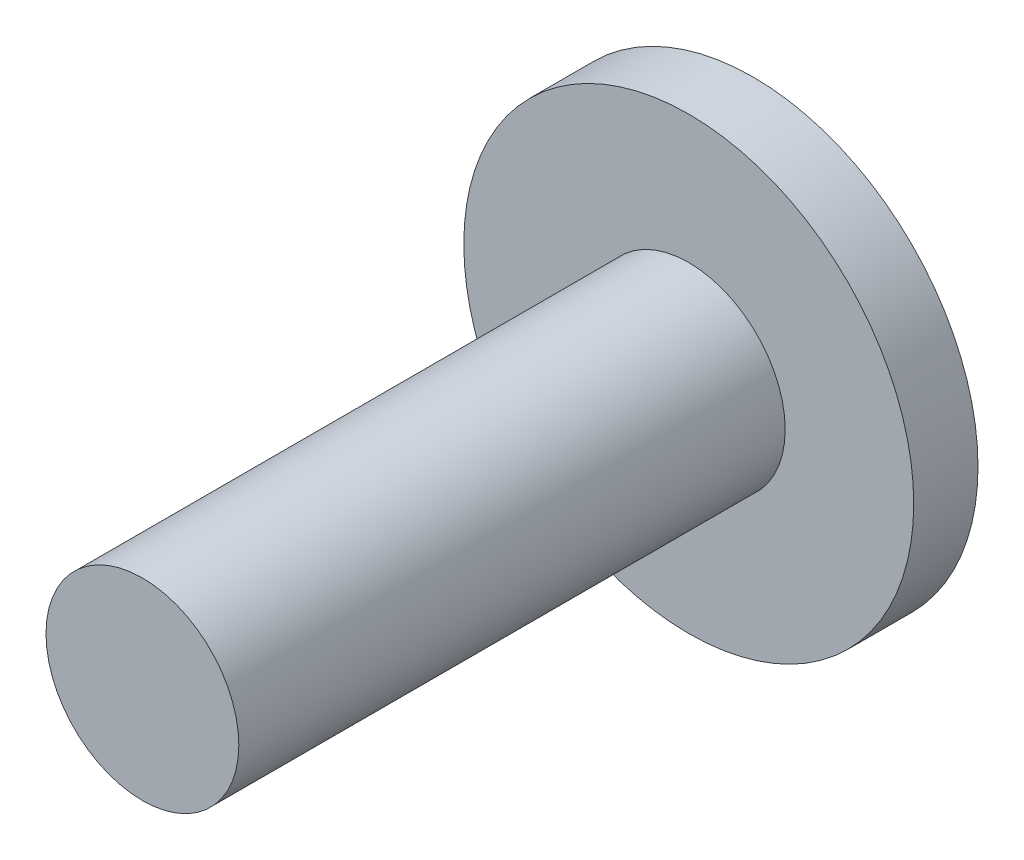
ISO-10303-21;
HEADER;
FILE_DESCRIPTION(('STEP AP214'),'2;1');
FILE_NAME('part.step','',(''),(''),'','','');
FILE_SCHEMA(('AUTOMOTIVE_DESIGN { 1 0 10303 214 1 1 1 1 }'));
ENDSEC;
DATA;
#1=APPLICATION_CONTEXT('core data for automotive mechanical design processes');
#2=APPLICATION_PROTOCOL_DEFINITION('international standard','automotive_design',2000,#1);
#3=PRODUCT_CONTEXT('',#1,'mechanical');
#4=PRODUCT('Part','Part','',(#3));
#5=PRODUCT_RELATED_PRODUCT_CATEGORY('part','',(#4));
#6=PRODUCT_DEFINITION_FORMATION('','',#4);
#7=PRODUCT_DEFINITION_CONTEXT('part definition',#1,'design');
#8=PRODUCT_DEFINITION('design','',#6,#7);
#9=PRODUCT_DEFINITION_SHAPE('','',#8);
#10=(LENGTH_UNIT() NAMED_UNIT(*) SI_UNIT(.MILLI.,.METRE.));
#11=(NAMED_UNIT(*) PLANE_ANGLE_UNIT() SI_UNIT($,.RADIAN.));
#12=(NAMED_UNIT(*) SI_UNIT($,.STERADIAN.) SOLID_ANGLE_UNIT());
#13=UNCERTAINTY_MEASURE_WITH_UNIT(LENGTH_MEASURE(1.E-05),#10,'distance_accuracy_value','');
#14=(GEOMETRIC_REPRESENTATION_CONTEXT(3) GLOBAL_UNCERTAINTY_ASSIGNED_CONTEXT((#13)) GLOBAL_UNIT_ASSIGNED_CONTEXT((#10,
#11,#12)) REPRESENTATION_CONTEXT('',''));
#15=CARTESIAN_POINT('',(0.,0.,0.));
#16=DIRECTION('',(0.,0.,1.));
#17=DIRECTION('',(1.,0.,0.));
#18=AXIS2_PLACEMENT_3D('',#15,#16,#17);
#19=CARTESIAN_POINT('',(0.,0.,2.));
#20=DIRECTION('',(0.,0.,1.));
#21=DIRECTION('',(1.,0.,0.));
#22=AXIS2_PLACEMENT_3D('',#19,#20,#21);
#23=PLANE('',#22);
#24=CARTESIAN_POINT('',(0.,0.,2.));
#25=DIRECTION('',(0.,0.,1.));
#26=DIRECTION('',(1.,0.,0.));
#27=AXIS2_PLACEMENT_3D('',#24,#25,#26);
#28=CIRCLE('',#27,7.);
#29=CARTESIAN_POINT('',(7.,0.,2.));
#30=VERTEX_POINT('',#29);
#31=EDGE_CURVE('E10',#30,#30,#28,.T.);
#32=ORIENTED_EDGE('',*,*,#31,.T.);
#33=EDGE_LOOP('',(#32));
#34=FACE_BOUND('',#33,.T.);
#35=CARTESIAN_POINT('',(0.,0.,2.));
#36=DIRECTION('',(0.,0.,1.));
#37=DIRECTION('',(1.,0.,0.));
#38=AXIS2_PLACEMENT_3D('',#35,#36,#37);
#39=CIRCLE('',#38,3.);
#40=CARTESIAN_POINT('',(3.,0.,2.));
#41=VERTEX_POINT('',#40);
#42=EDGE_CURVE('E43',#41,#41,#39,.T.);
#43=ORIENTED_EDGE('',*,*,#42,.F.);
#44=EDGE_LOOP('',(#43));
#45=FACE_BOUND('',#44,.T.);
#46=ADVANCED_FACE('F30',(#34,#45),#23,.T.);
#47=CARTESIAN_POINT('',(0.,0.,2.));
#48=DIRECTION('',(0.,0.,-1.));
#49=DIRECTION('',(-1.,0.,0.));
#50=AXIS2_PLACEMENT_3D('',#47,#48,#49);
#51=CYLINDRICAL_SURFACE('',#50,7.);
#52=ORIENTED_EDGE('',*,*,#31,.F.);
#53=EDGE_LOOP('',(#52));
#54=FACE_BOUND('',#53,.T.);
#55=CARTESIAN_POINT('',(0.,0.,0.));
#56=DIRECTION('',(0.,0.,1.));
#57=DIRECTION('',(1.,0.,0.));
#58=AXIS2_PLACEMENT_3D('',#55,#56,#57);
#59=CIRCLE('',#58,7.);
#60=CARTESIAN_POINT('',(7.,0.,0.));
#61=VERTEX_POINT('',#60);
#62=EDGE_CURVE('E34',#61,#61,#59,.T.);
#63=ORIENTED_EDGE('',*,*,#62,.T.);
#64=EDGE_LOOP('',(#63));
#65=FACE_BOUND('',#64,.T.);
#66=ADVANCED_FACE('F32',(#54,#65),#51,.T.);
#67=CARTESIAN_POINT('',(0.,0.,0.));
#68=DIRECTION('',(0.,0.,1.));
#69=DIRECTION('',(1.,0.,0.));
#70=AXIS2_PLACEMENT_3D('',#67,#68,#69);
#71=PLANE('',#70);
#72=ORIENTED_EDGE('',*,*,#62,.F.);
#73=EDGE_LOOP('',(#72));
#74=FACE_BOUND('',#73,.T.);
#75=ADVANCED_FACE('F54',(#74),#71,.F.);
#76=CARTESIAN_POINT('',(0.,0.,19.));
#77=DIRECTION('',(0.,0.,-1.));
#78=DIRECTION('',(-1.,0.,0.));
#79=AXIS2_PLACEMENT_3D('',#76,#77,#78);
#80=CYLINDRICAL_SURFACE('',#79,3.);
#81=CARTESIAN_POINT('',(0.,0.,19.));
#82=DIRECTION('',(0.,0.,1.));
#83=DIRECTION('',(1.,0.,0.));
#84=AXIS2_PLACEMENT_3D('',#81,#82,#83);
#85=CIRCLE('',#84,3.);
#86=CARTESIAN_POINT('',(3.,0.,19.));
#87=VERTEX_POINT('',#86);
#88=EDGE_CURVE('E41',#87,#87,#85,.T.);
#89=ORIENTED_EDGE('',*,*,#88,.F.);
#90=EDGE_LOOP('',(#89));
#91=FACE_BOUND('',#90,.T.);
#92=ORIENTED_EDGE('',*,*,#42,.T.);
#93=EDGE_LOOP('',(#92));
#94=FACE_BOUND('',#93,.T.);
#95=ADVANCED_FACE('F51',(#91,#94),#80,.T.);
#96=CARTESIAN_POINT('',(0.,0.,19.));
#97=DIRECTION('',(0.,0.,1.));
#98=DIRECTION('',(1.,0.,0.));
#99=AXIS2_PLACEMENT_3D('',#96,#97,#98);
#100=PLANE('',#99);
#101=ORIENTED_EDGE('',*,*,#88,.T.);
#102=EDGE_LOOP('',(#101));
#103=FACE_BOUND('',#102,.T.);
#104=ADVANCED_FACE('F49',(#103),#100,.T.);
#105=CLOSED_SHELL('',(#46,#66,#75,#95,#104));
#106=MANIFOLD_SOLID_BREP('B2',#105);
#107=ADVANCED_BREP_SHAPE_REPRESENTATION('',(#18,#106),#14);
#108=SHAPE_DEFINITION_REPRESENTATION(#9,#107);
ENDSEC;
END-ISO-10303-21;
